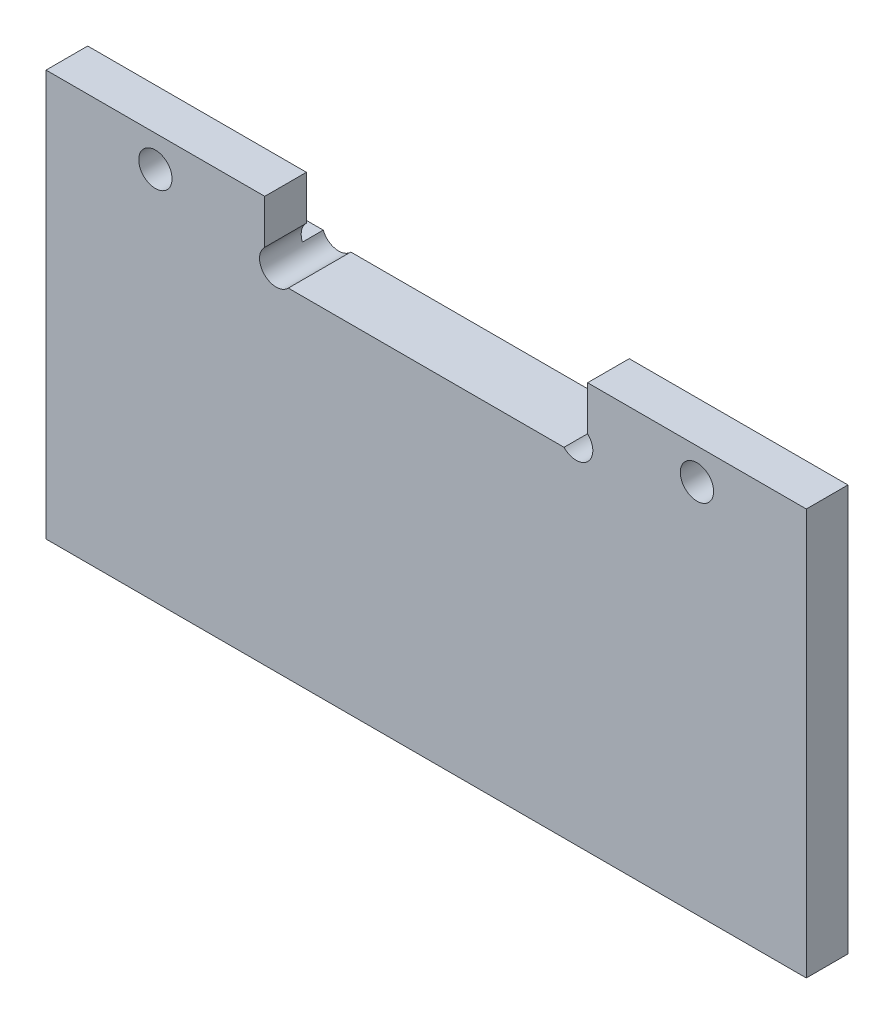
ISO-10303-21;
HEADER;
FILE_DESCRIPTION(('STEP AP214'),'2;1');
FILE_NAME('part.step','',(''),(''),'','','');
FILE_SCHEMA(('AUTOMOTIVE_DESIGN { 1 0 10303 214 1 1 1 1 }'));
ENDSEC;
DATA;
#1=APPLICATION_CONTEXT('core data for automotive mechanical design processes');
#2=APPLICATION_PROTOCOL_DEFINITION('international standard','automotive_design',2000,#1);
#3=PRODUCT_CONTEXT('',#1,'mechanical');
#4=PRODUCT('Part','Part','',(#3));
#5=PRODUCT_RELATED_PRODUCT_CATEGORY('part','',(#4));
#6=PRODUCT_DEFINITION_FORMATION('','',#4);
#7=PRODUCT_DEFINITION_CONTEXT('part definition',#1,'design');
#8=PRODUCT_DEFINITION('design','',#6,#7);
#9=PRODUCT_DEFINITION_SHAPE('','',#8);
#10=(LENGTH_UNIT() NAMED_UNIT(*) SI_UNIT(.MILLI.,.METRE.));
#11=(NAMED_UNIT(*) PLANE_ANGLE_UNIT() SI_UNIT($,.RADIAN.));
#12=(NAMED_UNIT(*) SI_UNIT($,.STERADIAN.) SOLID_ANGLE_UNIT());
#13=UNCERTAINTY_MEASURE_WITH_UNIT(LENGTH_MEASURE(1.E-05),#10,'distance_accuracy_value','');
#14=(GEOMETRIC_REPRESENTATION_CONTEXT(3) GLOBAL_UNCERTAINTY_ASSIGNED_CONTEXT((#13)) GLOBAL_UNIT_ASSIGNED_CONTEXT((#10,
#11,#12)) REPRESENTATION_CONTEXT('',''));
#15=CARTESIAN_POINT('',(0.,0.,0.));
#16=DIRECTION('',(0.,0.,1.));
#17=DIRECTION('',(1.,0.,0.));
#18=AXIS2_PLACEMENT_3D('',#15,#16,#17);
#19=CARTESIAN_POINT('',(-40.,40.,6.));
#20=DIRECTION('',(1.,0.,0.));
#21=DIRECTION('',(0.,0.,-1.));
#22=AXIS2_PLACEMENT_3D('',#19,#20,#21);
#23=PLANE('',#22);
#24=DIRECTION('',(0.,1.,0.));
#25=VECTOR('',#24,1.);
#26=CARTESIAN_POINT('',(-40.,40.,2.));
#27=LINE('',#26,#25);
#28=CARTESIAN_POINT('',(-40.,1.,2.));
#29=VERTEX_POINT('',#28);
#30=CARTESIAN_POINT('',(-40.,40.,2.));
#31=VERTEX_POINT('',#30);
#32=EDGE_CURVE('E163',#29,#31,#27,.T.);
#33=ORIENTED_EDGE('',*,*,#32,.F.);
#34=DIRECTION('',(0.,0.,-1.));
#35=VECTOR('',#34,1.);
#36=CARTESIAN_POINT('',(-40.,1.,6.));
#37=LINE('',#36,#35);
#38=CARTESIAN_POINT('',(-40.,1.,6.));
#39=VERTEX_POINT('',#38);
#40=EDGE_CURVE('E222',#39,#29,#37,.T.);
#41=ORIENTED_EDGE('',*,*,#40,.F.);
#42=DIRECTION('',(0.,-1.,0.));
#43=VECTOR('',#42,1.);
#44=CARTESIAN_POINT('',(-40.,40.,6.));
#45=LINE('',#44,#43);
#46=CARTESIAN_POINT('',(-40.,40.,6.));
#47=VERTEX_POINT('',#46);
#48=EDGE_CURVE('E200',#47,#39,#45,.T.);
#49=ORIENTED_EDGE('',*,*,#48,.F.);
#50=DIRECTION('',(0.,0.,-1.));
#51=VECTOR('',#50,1.);
#52=CARTESIAN_POINT('',(-40.,40.,6.));
#53=LINE('',#52,#51);
#54=EDGE_CURVE('E213',#47,#31,#53,.T.);
#55=ORIENTED_EDGE('',*,*,#54,.T.);
#56=EDGE_LOOP('',(#33,#41,#49,#55));
#57=FACE_BOUND('',#56,.T.);
#58=ADVANCED_FACE('F26',(#57),#23,.F.);
#59=CARTESIAN_POINT('',(-40.,1.,6.));
#60=DIRECTION('',(0.,1.,0.));
#61=DIRECTION('',(0.,0.,1.));
#62=AXIS2_PLACEMENT_3D('',#59,#60,#61);
#63=PLANE('',#62);
#64=DIRECTION('',(-1.,0.,0.));
#65=VECTOR('',#64,1.);
#66=CARTESIAN_POINT('',(-40.,1.,2.));
#67=LINE('',#66,#65);
#68=CARTESIAN_POINT('',(33.,0.999999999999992,2.));
#69=VERTEX_POINT('',#68);
#70=EDGE_CURVE('E150',#69,#29,#67,.T.);
#71=ORIENTED_EDGE('',*,*,#70,.F.);
#72=DIRECTION('',(0.,0.,-1.));
#73=VECTOR('',#72,1.);
#74=CARTESIAN_POINT('',(33.,1.,6.));
#75=LINE('',#74,#73);
#76=CARTESIAN_POINT('',(33.,1.,6.));
#77=VERTEX_POINT('',#76);
#78=EDGE_CURVE('E219',#77,#69,#75,.T.);
#79=ORIENTED_EDGE('',*,*,#78,.F.);
#80=DIRECTION('',(1.,0.,0.));
#81=VECTOR('',#80,1.);
#82=CARTESIAN_POINT('',(-40.,1.,6.));
#83=LINE('',#82,#81);
#84=EDGE_CURVE('E205',#39,#77,#83,.T.);
#85=ORIENTED_EDGE('',*,*,#84,.F.);
#86=ORIENTED_EDGE('',*,*,#40,.T.);
#87=EDGE_LOOP('',(#71,#79,#85,#86));
#88=FACE_BOUND('',#87,.T.);
#89=ADVANCED_FACE('F277',(#88),#63,.F.);
#90=CARTESIAN_POINT('',(33.,40.,6.));
#91=DIRECTION('',(-1.,0.,0.));
#92=DIRECTION('',(0.,-1.,0.));
#93=AXIS2_PLACEMENT_3D('',#90,#91,#92);
#94=PLANE('',#93);
#95=ORIENTED_EDGE('',*,*,#78,.T.);
#96=DIRECTION('',(0.,-1.,0.));
#97=VECTOR('',#96,1.);
#98=CARTESIAN_POINT('',(33.,40.,2.));
#99=LINE('',#98,#97);
#100=CARTESIAN_POINT('',(33.,40.,2.));
#101=VERTEX_POINT('',#100);
#102=EDGE_CURVE('E180',#101,#69,#99,.T.);
#103=ORIENTED_EDGE('',*,*,#102,.F.);
#104=DIRECTION('',(0.,0.,-1.));
#105=VECTOR('',#104,1.);
#106=CARTESIAN_POINT('',(33.,40.,6.));
#107=LINE('',#106,#105);
#108=CARTESIAN_POINT('',(33.,40.,6.));
#109=VERTEX_POINT('',#108);
#110=EDGE_CURVE('E216',#109,#101,#107,.T.);
#111=ORIENTED_EDGE('',*,*,#110,.F.);
#112=DIRECTION('',(0.,1.,0.));
#113=VECTOR('',#112,1.);
#114=CARTESIAN_POINT('',(33.,40.,6.));
#115=LINE('',#114,#113);
#116=EDGE_CURVE('E207',#77,#109,#115,.T.);
#117=ORIENTED_EDGE('',*,*,#116,.F.);
#118=EDGE_LOOP('',(#95,#103,#111,#117));
#119=FACE_BOUND('',#118,.T.);
#120=ADVANCED_FACE('F283',(#119),#94,.F.);
#121=CARTESIAN_POINT('',(-40.,40.,6.));
#122=DIRECTION('',(0.,-1.,0.));
#123=DIRECTION('',(0.,0.,-1.));
#124=AXIS2_PLACEMENT_3D('',#121,#122,#123);
#125=PLANE('',#124);
#126=DIRECTION('',(1.,0.,0.));
#127=VECTOR('',#126,1.);
#128=CARTESIAN_POINT('',(33.,40.,2.));
#129=LINE('',#128,#127);
#130=CARTESIAN_POINT('',(12.,40.,2.));
#131=VERTEX_POINT('',#130);
#132=EDGE_CURVE('E184',#131,#101,#129,.T.);
#133=ORIENTED_EDGE('',*,*,#132,.F.);
#134=DIRECTION('',(0.,0.,1.));
#135=VECTOR('',#134,1.);
#136=CARTESIAN_POINT('',(12.,40.,0.));
#137=LINE('',#136,#135);
#138=CARTESIAN_POINT('',(12.,40.,6.));
#139=VERTEX_POINT('',#138);
#140=EDGE_CURVE('E197',#131,#139,#137,.T.);
#141=ORIENTED_EDGE('',*,*,#140,.T.);
#142=DIRECTION('',(-1.,0.,0.));
#143=VECTOR('',#142,1.);
#144=CARTESIAN_POINT('',(-40.,40.,6.));
#145=LINE('',#144,#143);
#146=EDGE_CURVE('E210',#109,#139,#145,.T.);
#147=ORIENTED_EDGE('',*,*,#146,.F.);
#148=ORIENTED_EDGE('',*,*,#110,.T.);
#149=EDGE_LOOP('',(#133,#141,#147,#148));
#150=FACE_BOUND('',#149,.T.);
#151=ADVANCED_FACE('F301',(#150),#125,.F.);
#152=DIRECTION('',(0.,0.,1.));
#153=VECTOR('',#152,1.);
#154=CARTESIAN_POINT('',(-19.,40.,0.));
#155=LINE('',#154,#153);
#156=CARTESIAN_POINT('',(-19.,40.,2.));
#157=VERTEX_POINT('',#156);
#158=CARTESIAN_POINT('',(-19.,40.,6.));
#159=VERTEX_POINT('',#158);
#160=EDGE_CURVE('E198',#157,#159,#155,.T.);
#161=ORIENTED_EDGE('',*,*,#160,.F.);
#162=DIRECTION('',(1.,0.,0.));
#163=VECTOR('',#162,1.);
#164=CARTESIAN_POINT('',(-40.,40.,2.));
#165=LINE('',#164,#163);
#166=EDGE_CURVE('E166',#31,#157,#165,.T.);
#167=ORIENTED_EDGE('',*,*,#166,.F.);
#168=ORIENTED_EDGE('',*,*,#54,.F.);
#169=EDGE_CURVE('E209',#159,#47,#145,.T.);
#170=ORIENTED_EDGE('',*,*,#169,.F.);
#171=EDGE_LOOP('',(#161,#167,#168,#170));
#172=FACE_BOUND('',#171,.T.);
#173=ADVANCED_FACE('F259',(#172),#125,.F.);
#174=CARTESIAN_POINT('',(-40.,1.,6.));
#175=DIRECTION('',(0.,0.,1.));
#176=DIRECTION('',(1.,0.,0.));
#177=AXIS2_PLACEMENT_3D('',#174,#175,#176);
#178=PLANE('',#177);
#179=CARTESIAN_POINT('',(10.9,34.6,6.));
#180=DIRECTION('',(0.,0.,1.));
#181=DIRECTION('',(1.,0.,0.));
#182=AXIS2_PLACEMENT_3D('',#179,#180,#181);
#183=CIRCLE('',#182,1.6);
#184=CARTESIAN_POINT('',(9.73810499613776,33.5,6.));
#185=VERTEX_POINT('',#184);
#186=CARTESIAN_POINT('',(12.,35.7618950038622,6.));
#187=VERTEX_POINT('',#186);
#188=EDGE_CURVE('E339',#185,#187,#183,.T.);
#189=ORIENTED_EDGE('',*,*,#188,.F.);
#190=DIRECTION('',(1.,0.,0.));
#191=VECTOR('',#190,1.);
#192=CARTESIAN_POINT('',(-19.,33.5,6.));
#193=LINE('',#192,#191);
#194=CARTESIAN_POINT('',(-16.7381049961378,33.5,6.));
#195=VERTEX_POINT('',#194);
#196=EDGE_CURVE('E189',#195,#185,#193,.T.);
#197=ORIENTED_EDGE('',*,*,#196,.F.);
#198=CARTESIAN_POINT('',(-17.9,34.6,6.));
#199=DIRECTION('',(0.,0.,1.));
#200=DIRECTION('',(1.,0.,0.));
#201=AXIS2_PLACEMENT_3D('',#198,#199,#200);
#202=CIRCLE('',#201,1.6);
#203=CARTESIAN_POINT('',(-19.,35.7618950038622,6.));
#204=VERTEX_POINT('',#203);
#205=EDGE_CURVE('E326',#204,#195,#202,.T.);
#206=ORIENTED_EDGE('',*,*,#205,.F.);
#207=DIRECTION('',(0.,-1.,0.));
#208=VECTOR('',#207,1.);
#209=CARTESIAN_POINT('',(-19.,40.,6.));
#210=LINE('',#209,#208);
#211=EDGE_CURVE('E186',#159,#204,#210,.T.);
#212=ORIENTED_EDGE('',*,*,#211,.F.);
#213=ORIENTED_EDGE('',*,*,#169,.T.);
#214=ORIENTED_EDGE('',*,*,#48,.T.);
#215=ORIENTED_EDGE('',*,*,#84,.T.);
#216=ORIENTED_EDGE('',*,*,#116,.T.);
#217=ORIENTED_EDGE('',*,*,#146,.T.);
#218=DIRECTION('',(0.,1.,0.));
#219=VECTOR('',#218,1.);
#220=CARTESIAN_POINT('',(12.,40.,6.));
#221=LINE('',#220,#219);
#222=EDGE_CURVE('E192',#187,#139,#221,.T.);
#223=ORIENTED_EDGE('',*,*,#222,.F.);
#224=EDGE_LOOP('',(#189,#197,#206,#212,#213,#214,#215,#216,#217,#223));
#225=FACE_BOUND('',#224,.T.);
#226=CARTESIAN_POINT('',(-29.5,37.,6.));
#227=DIRECTION('',(0.,0.,1.));
#228=DIRECTION('',(1.,0.,0.));
#229=AXIS2_PLACEMENT_3D('',#226,#227,#228);
#230=CIRCLE('',#229,1.6);
#231=CARTESIAN_POINT('',(-27.9,37.,6.));
#232=VERTEX_POINT('',#231);
#233=EDGE_CURVE('E231',#232,#232,#230,.T.);
#234=ORIENTED_EDGE('',*,*,#233,.F.);
#235=EDGE_LOOP('',(#234));
#236=FACE_BOUND('',#235,.T.);
#237=CARTESIAN_POINT('',(22.5,37.,6.));
#238=DIRECTION('',(0.,0.,1.));
#239=DIRECTION('',(1.,0.,0.));
#240=AXIS2_PLACEMENT_3D('',#237,#238,#239);
#241=CIRCLE('',#240,1.6);
#242=CARTESIAN_POINT('',(24.1,37.,6.));
#243=VERTEX_POINT('',#242);
#244=EDGE_CURVE('E169',#243,#243,#241,.T.);
#245=ORIENTED_EDGE('',*,*,#244,.F.);
#246=EDGE_LOOP('',(#245));
#247=FACE_BOUND('',#246,.T.);
#248=ADVANCED_FACE('F256',(#225,#236,#247),#178,.T.);
#249=CARTESIAN_POINT('',(-40.,1.,0.));
#250=DIRECTION('',(0.,0.,1.));
#251=DIRECTION('',(1.,0.,0.));
#252=AXIS2_PLACEMENT_3D('',#249,#250,#251);
#253=PLANE('',#252);
#254=DIRECTION('',(-1.,0.,0.));
#255=VECTOR('',#254,1.);
#256=CARTESIAN_POINT('',(33.,34.,0.));
#257=LINE('',#256,#255);
#258=CARTESIAN_POINT('',(29.8,34.,0.));
#259=VERTEX_POINT('',#258);
#260=CARTESIAN_POINT('',(12.3832396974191,34.,0.));
#261=VERTEX_POINT('',#260);
#262=EDGE_CURVE('E178',#259,#261,#257,.T.);
#263=ORIENTED_EDGE('',*,*,#262,.F.);
#264=DIRECTION('',(0.,1.,0.));
#265=VECTOR('',#264,1.);
#266=CARTESIAN_POINT('',(29.8,4.19999999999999,0.));
#267=LINE('',#266,#265);
#268=CARTESIAN_POINT('',(29.8,4.19999999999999,0.));
#269=VERTEX_POINT('',#268);
#270=EDGE_CURVE('E355',#269,#259,#267,.T.);
#271=ORIENTED_EDGE('',*,*,#270,.F.);
#272=DIRECTION('',(1.,0.,0.));
#273=VECTOR('',#272,1.);
#274=CARTESIAN_POINT('',(29.8,4.19999999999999,0.));
#275=LINE('',#274,#273);
#276=CARTESIAN_POINT('',(-36.8,4.19999999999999,0.));
#277=VERTEX_POINT('',#276);
#278=EDGE_CURVE('E160',#277,#269,#275,.T.);
#279=ORIENTED_EDGE('',*,*,#278,.F.);
#280=DIRECTION('',(0.,-1.,0.));
#281=VECTOR('',#280,1.);
#282=CARTESIAN_POINT('',(-36.8,4.19999999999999,0.));
#283=LINE('',#282,#281);
#284=CARTESIAN_POINT('',(-36.8,34.,0.));
#285=VERTEX_POINT('',#284);
#286=EDGE_CURVE('E141',#285,#277,#283,.T.);
#287=ORIENTED_EDGE('',*,*,#286,.F.);
#288=DIRECTION('',(-1.,0.,0.));
#289=VECTOR('',#288,1.);
#290=CARTESIAN_POINT('',(-40.,34.,0.));
#291=LINE('',#290,#289);
#292=CARTESIAN_POINT('',(-19.3832396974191,34.,0.));
#293=VERTEX_POINT('',#292);
#294=EDGE_CURVE('E157',#293,#285,#291,.T.);
#295=ORIENTED_EDGE('',*,*,#294,.F.);
#296=CARTESIAN_POINT('',(-17.9,34.6,0.));
#297=DIRECTION('',(0.,0.,1.));
#298=DIRECTION('',(1.,0.,0.));
#299=AXIS2_PLACEMENT_3D('',#296,#297,#298);
#300=CIRCLE('',#299,1.6);
#301=CARTESIAN_POINT('',(-16.7381049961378,33.5,0.));
#302=VERTEX_POINT('',#301);
#303=EDGE_CURVE('E247',#293,#302,#300,.T.);
#304=ORIENTED_EDGE('',*,*,#303,.T.);
#305=DIRECTION('',(1.,0.,0.));
#306=VECTOR('',#305,1.);
#307=CARTESIAN_POINT('',(-19.,33.5,0.));
#308=LINE('',#307,#306);
#309=CARTESIAN_POINT('',(9.73810499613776,33.5,0.));
#310=VERTEX_POINT('',#309);
#311=EDGE_CURVE('E194',#302,#310,#308,.T.);
#312=ORIENTED_EDGE('',*,*,#311,.T.);
#313=CARTESIAN_POINT('',(10.9,34.6,0.));
#314=DIRECTION('',(0.,0.,1.));
#315=DIRECTION('',(1.,0.,0.));
#316=AXIS2_PLACEMENT_3D('',#313,#314,#315);
#317=CIRCLE('',#316,1.6);
#318=EDGE_CURVE('E329',#310,#261,#317,.T.);
#319=ORIENTED_EDGE('',*,*,#318,.T.);
#320=EDGE_LOOP('',(#263,#271,#279,#287,#295,#304,#312,#319));
#321=FACE_BOUND('',#320,.T.);
#322=ADVANCED_FACE('F155',(#321),#253,.F.);
#323=CARTESIAN_POINT('',(-19.,40.,0.));
#324=DIRECTION('',(-1.,0.,0.));
#325=DIRECTION('',(0.,-1.,0.));
#326=AXIS2_PLACEMENT_3D('',#323,#324,#325);
#327=PLANE('',#326);
#328=ORIENTED_EDGE('',*,*,#211,.T.);
#329=DIRECTION('',(0.,0.,1.));
#330=VECTOR('',#329,1.);
#331=CARTESIAN_POINT('',(-19.,35.7618950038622,0.));
#332=LINE('',#331,#330);
#333=CARTESIAN_POINT('',(-19.,35.7618950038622,2.));
#334=VERTEX_POINT('',#333);
#335=EDGE_CURVE('E238',#204,#334,#332,.F.);
#336=ORIENTED_EDGE('',*,*,#335,.T.);
#337=DIRECTION('',(0.,1.,0.));
#338=VECTOR('',#337,1.);
#339=CARTESIAN_POINT('',(-19.,40.,2.));
#340=LINE('',#339,#338);
#341=EDGE_CURVE('E227',#334,#157,#340,.T.);
#342=ORIENTED_EDGE('',*,*,#341,.T.);
#343=ORIENTED_EDGE('',*,*,#160,.T.);
#344=EDGE_LOOP('',(#328,#336,#342,#343));
#345=FACE_BOUND('',#344,.T.);
#346=ADVANCED_FACE('F241',(#345),#327,.F.);
#347=CARTESIAN_POINT('',(12.,40.,0.));
#348=DIRECTION('',(1.,0.,0.));
#349=DIRECTION('',(0.,0.,-1.));
#350=AXIS2_PLACEMENT_3D('',#347,#348,#349);
#351=PLANE('',#350);
#352=DIRECTION('',(0.,1.,0.));
#353=VECTOR('',#352,1.);
#354=CARTESIAN_POINT('',(12.,40.,2.));
#355=LINE('',#354,#353);
#356=CARTESIAN_POINT('',(12.,35.7618950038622,2.));
#357=VERTEX_POINT('',#356);
#358=EDGE_CURVE('E225',#357,#131,#355,.T.);
#359=ORIENTED_EDGE('',*,*,#358,.F.);
#360=DIRECTION('',(0.,0.,1.));
#361=VECTOR('',#360,1.);
#362=CARTESIAN_POINT('',(12.,35.7618950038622,0.));
#363=LINE('',#362,#361);
#364=EDGE_CURVE('E39',#357,#187,#363,.T.);
#365=ORIENTED_EDGE('',*,*,#364,.T.);
#366=ORIENTED_EDGE('',*,*,#222,.T.);
#367=ORIENTED_EDGE('',*,*,#140,.F.);
#368=EDGE_LOOP('',(#359,#365,#366,#367));
#369=FACE_BOUND('',#368,.T.);
#370=ADVANCED_FACE('F321',(#369),#351,.F.);
#371=CARTESIAN_POINT('',(-19.,33.5,0.));
#372=DIRECTION('',(0.,-1.,0.));
#373=DIRECTION('',(0.,0.,-1.));
#374=AXIS2_PLACEMENT_3D('',#371,#372,#373);
#375=PLANE('',#374);
#376=ORIENTED_EDGE('',*,*,#196,.T.);
#377=DIRECTION('',(0.,0.,1.));
#378=VECTOR('',#377,1.);
#379=CARTESIAN_POINT('',(9.73810499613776,33.5,0.));
#380=LINE('',#379,#378);
#381=EDGE_CURVE('E322',#185,#310,#380,.F.);
#382=ORIENTED_EDGE('',*,*,#381,.T.);
#383=ORIENTED_EDGE('',*,*,#311,.F.);
#384=DIRECTION('',(0.,0.,1.));
#385=VECTOR('',#384,1.);
#386=CARTESIAN_POINT('',(-16.7381049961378,33.5,0.));
#387=LINE('',#386,#385);
#388=EDGE_CURVE('E243',#302,#195,#387,.T.);
#389=ORIENTED_EDGE('',*,*,#388,.T.);
#390=EDGE_LOOP('',(#376,#382,#383,#389));
#391=FACE_BOUND('',#390,.T.);
#392=ADVANCED_FACE('F336',(#391),#375,.F.);
#393=CARTESIAN_POINT('',(33.,34.,2.));
#394=DIRECTION('',(0.,-1.,0.));
#395=DIRECTION('',(0.,0.,-1.));
#396=AXIS2_PLACEMENT_3D('',#393,#394,#395);
#397=PLANE('',#396);
#398=DIRECTION('',(-1.,0.,0.));
#399=VECTOR('',#398,1.);
#400=CARTESIAN_POINT('',(33.,34.,2.));
#401=LINE('',#400,#399);
#402=CARTESIAN_POINT('',(29.8,34.,2.));
#403=VERTEX_POINT('',#402);
#404=CARTESIAN_POINT('',(12.3832396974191,34.,2.));
#405=VERTEX_POINT('',#404);
#406=EDGE_CURVE('E182',#403,#405,#401,.T.);
#407=ORIENTED_EDGE('',*,*,#406,.F.);
#408=DIRECTION('',(0.,0.,-1.));
#409=VECTOR('',#408,1.);
#410=CARTESIAN_POINT('',(29.8,34.,2.));
#411=LINE('',#410,#409);
#412=EDGE_CURVE('E341',#403,#259,#411,.T.);
#413=ORIENTED_EDGE('',*,*,#412,.T.);
#414=ORIENTED_EDGE('',*,*,#262,.T.);
#415=DIRECTION('',(0.,0.,1.));
#416=VECTOR('',#415,1.);
#417=CARTESIAN_POINT('',(12.3832396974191,34.,0.));
#418=LINE('',#417,#416);
#419=EDGE_CURVE('E323',#261,#405,#418,.T.);
#420=ORIENTED_EDGE('',*,*,#419,.T.);
#421=EDGE_LOOP('',(#407,#413,#414,#420));
#422=FACE_BOUND('',#421,.T.);
#423=ADVANCED_FACE('F365',(#422),#397,.F.);
#424=CARTESIAN_POINT('',(33.,34.,2.));
#425=DIRECTION('',(0.,0.,-1.));
#426=DIRECTION('',(-1.,0.,0.));
#427=AXIS2_PLACEMENT_3D('',#424,#425,#426);
#428=PLANE('',#427);
#429=CARTESIAN_POINT('',(10.9,34.6,2.));
#430=DIRECTION('',(0.,0.,-1.));
#431=DIRECTION('',(-1.,0.,0.));
#432=AXIS2_PLACEMENT_3D('',#429,#430,#431);
#433=CIRCLE('',#432,1.6);
#434=EDGE_CURVE('E11',#357,#405,#433,.T.);
#435=ORIENTED_EDGE('',*,*,#434,.F.);
#436=ORIENTED_EDGE('',*,*,#358,.T.);
#437=ORIENTED_EDGE('',*,*,#132,.T.);
#438=ORIENTED_EDGE('',*,*,#102,.T.);
#439=ORIENTED_EDGE('',*,*,#70,.T.);
#440=ORIENTED_EDGE('',*,*,#32,.T.);
#441=ORIENTED_EDGE('',*,*,#166,.T.);
#442=ORIENTED_EDGE('',*,*,#341,.F.);
#443=CARTESIAN_POINT('',(-17.9,34.6,2.));
#444=DIRECTION('',(0.,0.,1.));
#445=DIRECTION('',(1.,0.,0.));
#446=AXIS2_PLACEMENT_3D('',#443,#444,#445);
#447=CIRCLE('',#446,1.6);
#448=CARTESIAN_POINT('',(-19.3832396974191,34.,2.));
#449=VERTEX_POINT('',#448);
#450=EDGE_CURVE('E33',#334,#449,#447,.T.);
#451=ORIENTED_EDGE('',*,*,#450,.T.);
#452=DIRECTION('',(-1.,0.,0.));
#453=VECTOR('',#452,1.);
#454=CARTESIAN_POINT('',(-40.,34.,2.));
#455=LINE('',#454,#453);
#456=CARTESIAN_POINT('',(-36.8,34.,2.));
#457=VERTEX_POINT('',#456);
#458=EDGE_CURVE('E176',#449,#457,#455,.T.);
#459=ORIENTED_EDGE('',*,*,#458,.T.);
#460=DIRECTION('',(0.,-1.,0.));
#461=VECTOR('',#460,1.);
#462=CARTESIAN_POINT('',(-36.8,4.19999999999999,2.));
#463=LINE('',#462,#461);
#464=CARTESIAN_POINT('',(-36.8,4.19999999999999,2.));
#465=VERTEX_POINT('',#464);
#466=EDGE_CURVE('E144',#457,#465,#463,.T.);
#467=ORIENTED_EDGE('',*,*,#466,.T.);
#468=DIRECTION('',(1.,0.,0.));
#469=VECTOR('',#468,1.);
#470=CARTESIAN_POINT('',(29.8,4.19999999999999,2.));
#471=LINE('',#470,#469);
#472=CARTESIAN_POINT('',(29.8,4.19999999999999,2.));
#473=VERTEX_POINT('',#472);
#474=EDGE_CURVE('E351',#465,#473,#471,.T.);
#475=ORIENTED_EDGE('',*,*,#474,.T.);
#476=DIRECTION('',(0.,1.,0.));
#477=VECTOR('',#476,1.);
#478=CARTESIAN_POINT('',(29.8,4.19999999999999,2.));
#479=LINE('',#478,#477);
#480=EDGE_CURVE('E293',#473,#403,#479,.T.);
#481=ORIENTED_EDGE('',*,*,#480,.T.);
#482=ORIENTED_EDGE('',*,*,#406,.T.);
#483=EDGE_LOOP('',(#435,#436,#437,#438,#439,#440,#441,#442,#451,#459,#467,#475,#481,#482));
#484=FACE_BOUND('',#483,.T.);
#485=CARTESIAN_POINT('',(22.5,37.,2.));
#486=DIRECTION('',(0.,0.,-1.));
#487=DIRECTION('',(-1.,0.,0.));
#488=AXIS2_PLACEMENT_3D('',#485,#486,#487);
#489=CIRCLE('',#488,1.6);
#490=CARTESIAN_POINT('',(20.9,37.,2.));
#491=VERTEX_POINT('',#490);
#492=EDGE_CURVE('E164',#491,#491,#489,.T.);
#493=ORIENTED_EDGE('',*,*,#492,.F.);
#494=EDGE_LOOP('',(#493));
#495=FACE_BOUND('',#494,.T.);
#496=CARTESIAN_POINT('',(-29.5,37.,2.));
#497=DIRECTION('',(0.,0.,1.));
#498=DIRECTION('',(1.,0.,0.));
#499=AXIS2_PLACEMENT_3D('',#496,#497,#498);
#500=CIRCLE('',#499,1.6);
#501=CARTESIAN_POINT('',(-27.9,37.,2.));
#502=VERTEX_POINT('',#501);
#503=EDGE_CURVE('E229',#502,#502,#500,.T.);
#504=ORIENTED_EDGE('',*,*,#503,.T.);
#505=EDGE_LOOP('',(#504));
#506=FACE_BOUND('',#505,.T.);
#507=ADVANCED_FACE('F234',(#484,#495,#506),#428,.T.);
#508=CARTESIAN_POINT('',(-40.,34.,2.));
#509=DIRECTION('',(0.,-1.,0.));
#510=DIRECTION('',(0.,0.,-1.));
#511=AXIS2_PLACEMENT_3D('',#508,#509,#510);
#512=PLANE('',#511);
#513=ORIENTED_EDGE('',*,*,#294,.T.);
#514=DIRECTION('',(0.,0.,-1.));
#515=VECTOR('',#514,1.);
#516=CARTESIAN_POINT('',(-36.8,34.,2.));
#517=LINE('',#516,#515);
#518=EDGE_CURVE('E138',#457,#285,#517,.T.);
#519=ORIENTED_EDGE('',*,*,#518,.F.);
#520=ORIENTED_EDGE('',*,*,#458,.F.);
#521=DIRECTION('',(0.,0.,1.));
#522=VECTOR('',#521,1.);
#523=CARTESIAN_POINT('',(-19.3832396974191,34.,0.));
#524=LINE('',#523,#522);
#525=EDGE_CURVE('E47',#449,#293,#524,.F.);
#526=ORIENTED_EDGE('',*,*,#525,.T.);
#527=EDGE_LOOP('',(#513,#519,#520,#526));
#528=FACE_BOUND('',#527,.T.);
#529=ADVANCED_FACE('F162',(#528),#512,.F.);
#530=CARTESIAN_POINT('',(22.5,37.,0.));
#531=DIRECTION('',(0.,0.,1.));
#532=DIRECTION('',(1.,0.,0.));
#533=AXIS2_PLACEMENT_3D('',#530,#531,#532);
#534=CYLINDRICAL_SURFACE('',#533,1.6);
#535=ORIENTED_EDGE('',*,*,#492,.T.);
#536=EDGE_LOOP('',(#535));
#537=FACE_BOUND('',#536,.T.);
#538=ORIENTED_EDGE('',*,*,#244,.T.);
#539=EDGE_LOOP('',(#538));
#540=FACE_BOUND('',#539,.T.);
#541=ADVANCED_FACE('F265',(#537,#540),#534,.F.);
#542=CARTESIAN_POINT('',(-29.5,37.,0.));
#543=DIRECTION('',(0.,0.,1.));
#544=DIRECTION('',(1.,0.,0.));
#545=AXIS2_PLACEMENT_3D('',#542,#543,#544);
#546=CYLINDRICAL_SURFACE('',#545,1.6);
#547=ORIENTED_EDGE('',*,*,#233,.T.);
#548=EDGE_LOOP('',(#547));
#549=FACE_BOUND('',#548,.T.);
#550=ORIENTED_EDGE('',*,*,#503,.F.);
#551=EDGE_LOOP('',(#550));
#552=FACE_BOUND('',#551,.T.);
#553=ADVANCED_FACE('F253',(#549,#552),#546,.F.);
#554=CARTESIAN_POINT('',(-17.9,34.6,0.));
#555=DIRECTION('',(0.,0.,1.));
#556=DIRECTION('',(1.,0.,0.));
#557=AXIS2_PLACEMENT_3D('',#554,#555,#556);
#558=CYLINDRICAL_SURFACE('',#557,1.6);
#559=ORIENTED_EDGE('',*,*,#303,.F.);
#560=ORIENTED_EDGE('',*,*,#525,.F.);
#561=ORIENTED_EDGE('',*,*,#450,.F.);
#562=ORIENTED_EDGE('',*,*,#335,.F.);
#563=ORIENTED_EDGE('',*,*,#205,.T.);
#564=ORIENTED_EDGE('',*,*,#388,.F.);
#565=EDGE_LOOP('',(#559,#560,#561,#562,#563,#564));
#566=FACE_BOUND('',#565,.T.);
#567=ADVANCED_FACE('F237',(#566),#558,.F.);
#568=CARTESIAN_POINT('',(10.9,34.6,0.));
#569=DIRECTION('',(0.,0.,1.));
#570=DIRECTION('',(1.,0.,0.));
#571=AXIS2_PLACEMENT_3D('',#568,#569,#570);
#572=CYLINDRICAL_SURFACE('',#571,1.6);
#573=ORIENTED_EDGE('',*,*,#188,.T.);
#574=ORIENTED_EDGE('',*,*,#364,.F.);
#575=ORIENTED_EDGE('',*,*,#434,.T.);
#576=ORIENTED_EDGE('',*,*,#419,.F.);
#577=ORIENTED_EDGE('',*,*,#318,.F.);
#578=ORIENTED_EDGE('',*,*,#381,.F.);
#579=EDGE_LOOP('',(#573,#574,#575,#576,#577,#578));
#580=FACE_BOUND('',#579,.T.);
#581=ADVANCED_FACE('F338',(#580),#572,.F.);
#582=CARTESIAN_POINT('',(29.8,4.19999999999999,2.));
#583=DIRECTION('',(-1.,0.,0.));
#584=DIRECTION('',(0.,0.,1.));
#585=AXIS2_PLACEMENT_3D('',#582,#583,#584);
#586=PLANE('',#585);
#587=ORIENTED_EDGE('',*,*,#270,.T.);
#588=ORIENTED_EDGE('',*,*,#412,.F.);
#589=ORIENTED_EDGE('',*,*,#480,.F.);
#590=DIRECTION('',(0.,0.,-1.));
#591=VECTOR('',#590,1.);
#592=CARTESIAN_POINT('',(29.8,4.19999999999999,2.));
#593=LINE('',#592,#591);
#594=EDGE_CURVE('E344',#473,#269,#593,.T.);
#595=ORIENTED_EDGE('',*,*,#594,.T.);
#596=EDGE_LOOP('',(#587,#588,#589,#595));
#597=FACE_BOUND('',#596,.T.);
#598=ADVANCED_FACE('F362',(#597),#586,.F.);
#599=CARTESIAN_POINT('',(29.8,4.19999999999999,2.));
#600=DIRECTION('',(0.,1.,0.));
#601=DIRECTION('',(0.,0.,1.));
#602=AXIS2_PLACEMENT_3D('',#599,#600,#601);
#603=PLANE('',#602);
#604=ORIENTED_EDGE('',*,*,#278,.T.);
#605=ORIENTED_EDGE('',*,*,#594,.F.);
#606=ORIENTED_EDGE('',*,*,#474,.F.);
#607=DIRECTION('',(0.,0.,-1.));
#608=VECTOR('',#607,1.);
#609=CARTESIAN_POINT('',(-36.8,4.19999999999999,2.));
#610=LINE('',#609,#608);
#611=EDGE_CURVE('E149',#465,#277,#610,.T.);
#612=ORIENTED_EDGE('',*,*,#611,.T.);
#613=EDGE_LOOP('',(#604,#605,#606,#612));
#614=FACE_BOUND('',#613,.T.);
#615=ADVANCED_FACE('F358',(#614),#603,.F.);
#616=CARTESIAN_POINT('',(-36.8,4.19999999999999,2.));
#617=DIRECTION('',(1.,0.,0.));
#618=DIRECTION('',(0.,0.,-1.));
#619=AXIS2_PLACEMENT_3D('',#616,#617,#618);
#620=PLANE('',#619);
#621=ORIENTED_EDGE('',*,*,#286,.T.);
#622=ORIENTED_EDGE('',*,*,#611,.F.);
#623=ORIENTED_EDGE('',*,*,#466,.F.);
#624=ORIENTED_EDGE('',*,*,#518,.T.);
#625=EDGE_LOOP('',(#621,#622,#623,#624));
#626=FACE_BOUND('',#625,.T.);
#627=ADVANCED_FACE('F140',(#626),#620,.F.);
#628=CLOSED_SHELL('',(#58,#89,#120,#151,#173,#248,#322,#346,#370,#392,#423,#507,#529,#541,#553,
#567,#581,#598,#615,#627));
#629=MANIFOLD_SOLID_BREP('B2',#628);
#630=ADVANCED_BREP_SHAPE_REPRESENTATION('',(#18,#629),#14);
#631=SHAPE_DEFINITION_REPRESENTATION(#9,#630);
ENDSEC;
END-ISO-10303-21;
